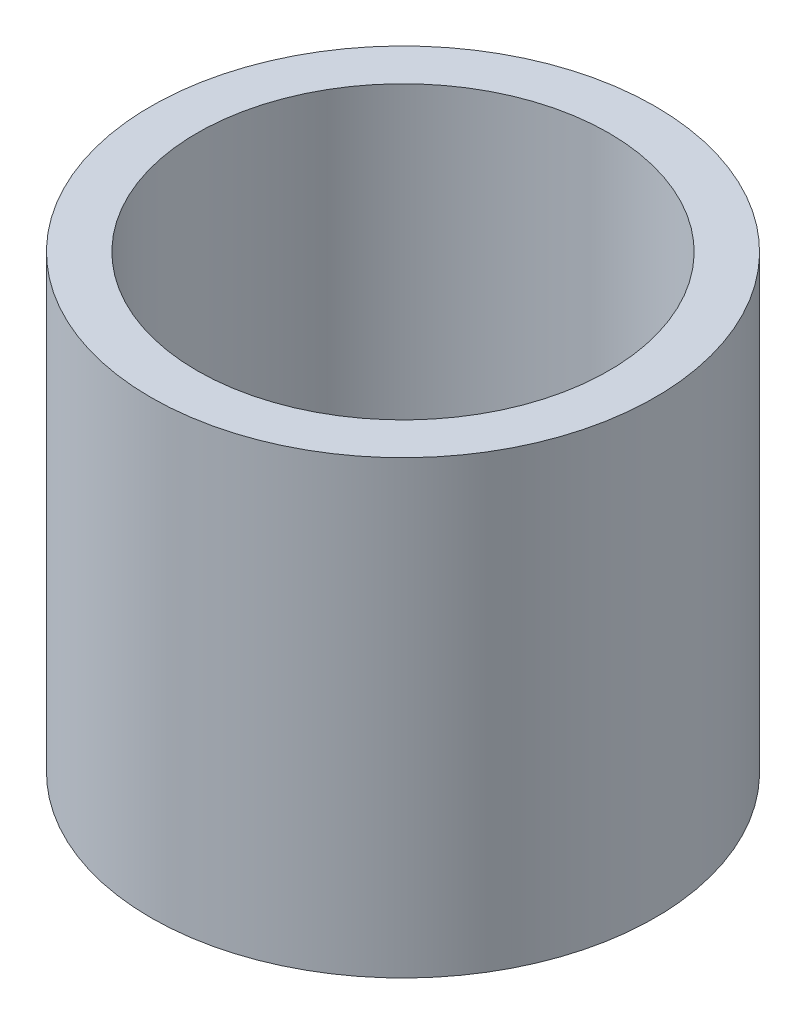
ISO-10303-21;
HEADER;
FILE_DESCRIPTION(('STEP AP214'),'2;1');
FILE_NAME('part.step','',(''),(''),'','','');
FILE_SCHEMA(('AUTOMOTIVE_DESIGN { 1 0 10303 214 1 1 1 1 }'));
ENDSEC;
DATA;
#1=APPLICATION_CONTEXT('core data for automotive mechanical design processes');
#2=APPLICATION_PROTOCOL_DEFINITION('international standard','automotive_design',2000,#1);
#3=PRODUCT_CONTEXT('',#1,'mechanical');
#4=PRODUCT('Part','Part','',(#3));
#5=PRODUCT_RELATED_PRODUCT_CATEGORY('part','',(#4));
#6=PRODUCT_DEFINITION_FORMATION('','',#4);
#7=PRODUCT_DEFINITION_CONTEXT('part definition',#1,'design');
#8=PRODUCT_DEFINITION('design','',#6,#7);
#9=PRODUCT_DEFINITION_SHAPE('','',#8);
#10=(LENGTH_UNIT() NAMED_UNIT(*) SI_UNIT(.MILLI.,.METRE.));
#11=(NAMED_UNIT(*) PLANE_ANGLE_UNIT() SI_UNIT($,.RADIAN.));
#12=(NAMED_UNIT(*) SI_UNIT($,.STERADIAN.) SOLID_ANGLE_UNIT());
#13=UNCERTAINTY_MEASURE_WITH_UNIT(LENGTH_MEASURE(1.E-05),#10,'distance_accuracy_value','');
#14=(GEOMETRIC_REPRESENTATION_CONTEXT(3) GLOBAL_UNCERTAINTY_ASSIGNED_CONTEXT((#13)) GLOBAL_UNIT_ASSIGNED_CONTEXT((#10,
#11,#12)) REPRESENTATION_CONTEXT('',''));
#15=CARTESIAN_POINT('',(0.,0.,0.));
#16=DIRECTION('',(0.,0.,1.));
#17=DIRECTION('',(1.,0.,0.));
#18=AXIS2_PLACEMENT_3D('',#15,#16,#17);
#19=CARTESIAN_POINT('',(0.,61.84646,0.));
#20=DIRECTION('',(0.,1.,0.));
#21=DIRECTION('',(0.,0.,1.));
#22=AXIS2_PLACEMENT_3D('',#19,#20,#21);
#23=PLANE('',#22);
#24=CARTESIAN_POINT('',(0.,61.84646,0.));
#25=DIRECTION('',(0.,1.,0.));
#26=DIRECTION('',(0.,0.,1.));
#27=AXIS2_PLACEMENT_3D('',#24,#25,#26);
#28=CIRCLE('',#27,34.6075);
#29=CARTESIAN_POINT('',(0.,61.84646,34.6075));
#30=VERTEX_POINT('',#29);
#31=EDGE_CURVE('E10',#30,#30,#28,.T.);
#32=ORIENTED_EDGE('',*,*,#31,.T.);
#33=EDGE_LOOP('',(#32));
#34=FACE_BOUND('',#33,.T.);
#35=CARTESIAN_POINT('',(0.,61.84646,0.));
#36=DIRECTION('',(0.,1.,0.));
#37=DIRECTION('',(0.,0.,1.));
#38=AXIS2_PLACEMENT_3D('',#35,#36,#37);
#39=CIRCLE('',#38,28.2575);
#40=CARTESIAN_POINT('',(0.,61.84646,28.2575));
#41=VERTEX_POINT('',#40);
#42=EDGE_CURVE('E56',#41,#41,#39,.T.);
#43=ORIENTED_EDGE('',*,*,#42,.F.);
#44=EDGE_LOOP('',(#43));
#45=FACE_BOUND('',#44,.T.);
#46=ADVANCED_FACE('F43',(#34,#45),#23,.T.);
#47=CARTESIAN_POINT('',(0.,0.,0.));
#48=DIRECTION('',(0.,1.,0.));
#49=DIRECTION('',(0.,0.,1.));
#50=AXIS2_PLACEMENT_3D('',#47,#48,#49);
#51=PLANE('',#50);
#52=CARTESIAN_POINT('',(0.,0.,0.));
#53=DIRECTION('',(0.,1.,0.));
#54=DIRECTION('',(0.,0.,1.));
#55=AXIS2_PLACEMENT_3D('',#52,#53,#54);
#56=CIRCLE('',#55,34.6075);
#57=CARTESIAN_POINT('',(0.,0.,34.6075));
#58=VERTEX_POINT('',#57);
#59=EDGE_CURVE('E47',#58,#58,#56,.T.);
#60=ORIENTED_EDGE('',*,*,#59,.F.);
#61=EDGE_LOOP('',(#60));
#62=FACE_BOUND('',#61,.T.);
#63=CARTESIAN_POINT('',(0.,0.,0.));
#64=DIRECTION('',(0.,1.,0.));
#65=DIRECTION('',(0.,0.,1.));
#66=AXIS2_PLACEMENT_3D('',#63,#64,#65);
#67=CIRCLE('',#66,28.2575);
#68=CARTESIAN_POINT('',(0.,0.,28.2575));
#69=VERTEX_POINT('',#68);
#70=EDGE_CURVE('E58',#69,#69,#67,.T.);
#71=ORIENTED_EDGE('',*,*,#70,.T.);
#72=EDGE_LOOP('',(#71));
#73=FACE_BOUND('',#72,.T.);
#74=ADVANCED_FACE('F70',(#62,#73),#51,.F.);
#75=CARTESIAN_POINT('',(0.,61.84646,0.));
#76=DIRECTION('',(0.,-1.,0.));
#77=DIRECTION('',(0.,0.,-1.));
#78=AXIS2_PLACEMENT_3D('',#75,#76,#77);
#79=CYLINDRICAL_SURFACE('',#78,34.6075);
#80=ORIENTED_EDGE('',*,*,#31,.F.);
#81=EDGE_LOOP('',(#80));
#82=FACE_BOUND('',#81,.T.);
#83=ORIENTED_EDGE('',*,*,#59,.T.);
#84=EDGE_LOOP('',(#83));
#85=FACE_BOUND('',#84,.T.);
#86=ADVANCED_FACE('F45',(#82,#85),#79,.T.);
#87=CARTESIAN_POINT('',(0.,61.84646,0.));
#88=DIRECTION('',(0.,-1.,0.));
#89=DIRECTION('',(0.,0.,-1.));
#90=AXIS2_PLACEMENT_3D('',#87,#88,#89);
#91=CYLINDRICAL_SURFACE('',#90,28.2575);
#92=ORIENTED_EDGE('',*,*,#42,.T.);
#93=EDGE_LOOP('',(#92));
#94=FACE_BOUND('',#93,.T.);
#95=ORIENTED_EDGE('',*,*,#70,.F.);
#96=EDGE_LOOP('',(#95));
#97=FACE_BOUND('',#96,.T.);
#98=ADVANCED_FACE('F66',(#94,#97),#91,.F.);
#99=CLOSED_SHELL('',(#46,#74,#86,#98));
#100=MANIFOLD_SOLID_BREP('B2',#99);
#101=ADVANCED_BREP_SHAPE_REPRESENTATION('',(#18,#100),#14);
#102=SHAPE_DEFINITION_REPRESENTATION(#9,#101);
ENDSEC;
END-ISO-10303-21;
